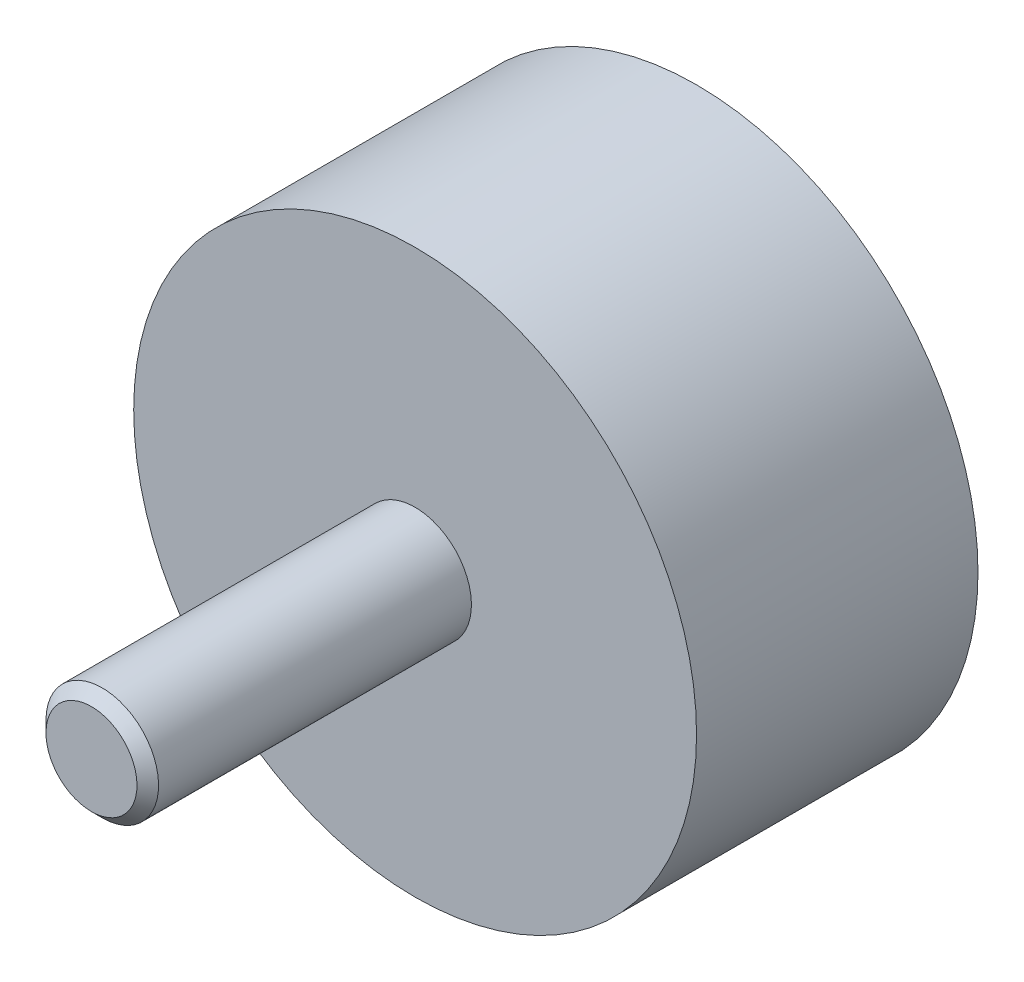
ISO-10303-21;
HEADER;
FILE_DESCRIPTION(('STEP AP214'),'2;1');
FILE_NAME('part.step','',(''),(''),'','','');
FILE_SCHEMA(('AUTOMOTIVE_DESIGN { 1 0 10303 214 1 1 1 1 }'));
ENDSEC;
DATA;
#1=APPLICATION_CONTEXT('core data for automotive mechanical design processes');
#2=APPLICATION_PROTOCOL_DEFINITION('international standard','automotive_design',2000,#1);
#3=PRODUCT_CONTEXT('',#1,'mechanical');
#4=PRODUCT('Part','Part','',(#3));
#5=PRODUCT_RELATED_PRODUCT_CATEGORY('part','',(#4));
#6=PRODUCT_DEFINITION_FORMATION('','',#4);
#7=PRODUCT_DEFINITION_CONTEXT('part definition',#1,'design');
#8=PRODUCT_DEFINITION('design','',#6,#7);
#9=PRODUCT_DEFINITION_SHAPE('','',#8);
#10=(LENGTH_UNIT() NAMED_UNIT(*) SI_UNIT(.MILLI.,.METRE.));
#11=(NAMED_UNIT(*) PLANE_ANGLE_UNIT() SI_UNIT($,.RADIAN.));
#12=(NAMED_UNIT(*) SI_UNIT($,.STERADIAN.) SOLID_ANGLE_UNIT());
#13=UNCERTAINTY_MEASURE_WITH_UNIT(LENGTH_MEASURE(1.E-05),#10,'distance_accuracy_value','');
#14=(GEOMETRIC_REPRESENTATION_CONTEXT(3) GLOBAL_UNCERTAINTY_ASSIGNED_CONTEXT((#13)) GLOBAL_UNIT_ASSIGNED_CONTEXT((#10,
#11,#12)) REPRESENTATION_CONTEXT('',''));
#15=CARTESIAN_POINT('',(0.,0.,0.));
#16=DIRECTION('',(0.,0.,1.));
#17=DIRECTION('',(1.,0.,0.));
#18=AXIS2_PLACEMENT_3D('',#15,#16,#17);
#19=CARTESIAN_POINT('',(18.666666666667,0.,20.));
#20=DIRECTION('',(0.,0.,1.));
#21=DIRECTION('',(0.,-1.,0.));
#22=AXIS2_PLACEMENT_3D('',#19,#20,#21);
#23=PLANE('',#22);
#24=CARTESIAN_POINT('',(0.,0.,20.));
#25=DIRECTION('',(0.,0.,1.));
#26=DIRECTION('',(0.,-1.,0.));
#27=AXIS2_PLACEMENT_3D('',#24,#25,#26);
#28=CIRCLE('',#27,4.);
#29=CARTESIAN_POINT('',(0.,-4.,20.));
#30=VERTEX_POINT('',#29);
#31=EDGE_CURVE('E23',#30,#30,#28,.T.);
#32=ORIENTED_EDGE('',*,*,#31,.F.);
#33=EDGE_LOOP('',(#32));
#34=FACE_BOUND('',#33,.T.);
#35=CARTESIAN_POINT('',(0.,0.,20.));
#36=DIRECTION('',(0.,0.,1.));
#37=DIRECTION('',(0.,-1.,0.));
#38=AXIS2_PLACEMENT_3D('',#35,#36,#37);
#39=CIRCLE('',#38,20.);
#40=CARTESIAN_POINT('',(0.,-20.,20.));
#41=VERTEX_POINT('',#40);
#42=EDGE_CURVE('E27',#41,#41,#39,.T.);
#43=ORIENTED_EDGE('',*,*,#42,.T.);
#44=EDGE_LOOP('',(#43));
#45=FACE_BOUND('',#44,.T.);
#46=ADVANCED_FACE('F12',(#34,#45),#23,.T.);
#47=CARTESIAN_POINT('',(0.,0.,0.66666666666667));
#48=DIRECTION('',(0.,0.,1.));
#49=DIRECTION('',(0.,-1.,0.));
#50=AXIS2_PLACEMENT_3D('',#47,#48,#49);
#51=CYLINDRICAL_SURFACE('',#50,20.);
#52=CARTESIAN_POINT('',(0.,0.,0.));
#53=DIRECTION('',(0.,0.,1.));
#54=DIRECTION('',(0.,-1.,0.));
#55=AXIS2_PLACEMENT_3D('',#52,#53,#54);
#56=CIRCLE('',#55,20.);
#57=CARTESIAN_POINT('',(0.,-20.,0.));
#58=VERTEX_POINT('',#57);
#59=EDGE_CURVE('E32',#58,#58,#56,.T.);
#60=ORIENTED_EDGE('',*,*,#59,.T.);
#61=EDGE_LOOP('',(#60));
#62=FACE_BOUND('',#61,.T.);
#63=ORIENTED_EDGE('',*,*,#42,.F.);
#64=EDGE_LOOP('',(#63));
#65=FACE_BOUND('',#64,.T.);
#66=ADVANCED_FACE('F63',(#62,#65),#51,.T.);
#67=CARTESIAN_POINT('',(20.,0.,0.));
#68=DIRECTION('',(0.,0.,-1.));
#69=DIRECTION('',(0.,1.,0.));
#70=AXIS2_PLACEMENT_3D('',#67,#68,#69);
#71=PLANE('',#70);
#72=CARTESIAN_POINT('',(0.,0.,0.));
#73=DIRECTION('',(0.,0.,-1.));
#74=DIRECTION('',(0.,1.,0.));
#75=AXIS2_PLACEMENT_3D('',#72,#73,#74);
#76=CIRCLE('',#75,4.5);
#77=CARTESIAN_POINT('',(0.,4.5,0.));
#78=VERTEX_POINT('',#77);
#79=EDGE_CURVE('E8',#78,#78,#76,.F.);
#80=ORIENTED_EDGE('',*,*,#79,.T.);
#81=EDGE_LOOP('',(#80));
#82=FACE_BOUND('',#81,.T.);
#83=ORIENTED_EDGE('',*,*,#59,.F.);
#84=EDGE_LOOP('',(#83));
#85=FACE_BOUND('',#84,.T.);
#86=ADVANCED_FACE('F68',(#82,#85),#71,.T.);
#87=CARTESIAN_POINT('',(0.,0.,43.));
#88=DIRECTION('',(0.,0.,1.));
#89=DIRECTION('',(0.,-1.,0.));
#90=AXIS2_PLACEMENT_3D('',#87,#88,#89);
#91=PLANE('',#90);
#92=CARTESIAN_POINT('',(0.,0.,43.));
#93=DIRECTION('',(0.,0.,1.));
#94=DIRECTION('',(0.,-1.,0.));
#95=AXIS2_PLACEMENT_3D('',#92,#93,#94);
#96=CIRCLE('',#95,3.233);
#97=CARTESIAN_POINT('',(0.,-3.233,43.));
#98=VERTEX_POINT('',#97);
#99=EDGE_CURVE('E35',#98,#98,#96,.T.);
#100=ORIENTED_EDGE('',*,*,#99,.T.);
#101=EDGE_LOOP('',(#100));
#102=FACE_BOUND('',#101,.T.);
#103=ADVANCED_FACE('F74',(#102),#91,.T.);
#104=CARTESIAN_POINT('',(0.,0.,43.));
#105=DIRECTION('',(0.,0.,-1.));
#106=DIRECTION('',(0.,1.,0.));
#107=AXIS2_PLACEMENT_3D('',#104,#105,#106);
#108=CONICAL_SURFACE('',#107,3.233,0.785398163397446);
#109=CARTESIAN_POINT('',(0.,0.,42.233));
#110=DIRECTION('',(0.,0.,1.));
#111=DIRECTION('',(0.,-1.,0.));
#112=AXIS2_PLACEMENT_3D('',#109,#110,#111);
#113=CIRCLE('',#112,4.);
#114=CARTESIAN_POINT('',(0.,-4.,42.233));
#115=VERTEX_POINT('',#114);
#116=EDGE_CURVE('E38',#115,#115,#113,.T.);
#117=ORIENTED_EDGE('',*,*,#116,.T.);
#118=EDGE_LOOP('',(#117));
#119=FACE_BOUND('',#118,.T.);
#120=ORIENTED_EDGE('',*,*,#99,.F.);
#121=EDGE_LOOP('',(#120));
#122=FACE_BOUND('',#121,.T.);
#123=ADVANCED_FACE('F57',(#119,#122),#108,.T.);
#124=CARTESIAN_POINT('',(0.,0.,20.));
#125=DIRECTION('',(0.,0.,1.));
#126=DIRECTION('',(0.,-1.,0.));
#127=AXIS2_PLACEMENT_3D('',#124,#125,#126);
#128=CYLINDRICAL_SURFACE('',#127,4.);
#129=ORIENTED_EDGE('',*,*,#31,.T.);
#130=EDGE_LOOP('',(#129));
#131=FACE_BOUND('',#130,.T.);
#132=ORIENTED_EDGE('',*,*,#116,.F.);
#133=EDGE_LOOP('',(#132));
#134=FACE_BOUND('',#133,.T.);
#135=ADVANCED_FACE('F49',(#131,#134),#128,.T.);
#136=CARTESIAN_POINT('',(0.,0.,0.));
#137=DIRECTION('',(0.,0.,1.));
#138=DIRECTION('',(0.,-1.,0.));
#139=AXIS2_PLACEMENT_3D('',#136,#137,#138);
#140=CYLINDRICAL_SURFACE('',#139,4.);
#141=CARTESIAN_POINT('',(0.,0.,0.499999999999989));
#142=DIRECTION('',(0.,0.,-1.));
#143=DIRECTION('',(0.,1.,0.));
#144=AXIS2_PLACEMENT_3D('',#141,#142,#143);
#145=CIRCLE('',#144,4.);
#146=CARTESIAN_POINT('',(0.,4.,0.499999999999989));
#147=VERTEX_POINT('',#146);
#148=EDGE_CURVE('E19',#147,#147,#145,.T.);
#149=ORIENTED_EDGE('',*,*,#148,.T.);
#150=EDGE_LOOP('',(#149));
#151=FACE_BOUND('',#150,.T.);
#152=CARTESIAN_POINT('',(0.,0.,8.));
#153=DIRECTION('',(0.,0.,-1.));
#154=DIRECTION('',(0.,1.,0.));
#155=AXIS2_PLACEMENT_3D('',#152,#153,#154);
#156=CIRCLE('',#155,4.);
#157=CARTESIAN_POINT('',(0.,4.,8.));
#158=VERTEX_POINT('',#157);
#159=EDGE_CURVE('E41',#158,#158,#156,.T.);
#160=ORIENTED_EDGE('',*,*,#159,.F.);
#161=EDGE_LOOP('',(#160));
#162=FACE_BOUND('',#161,.T.);
#163=ADVANCED_FACE('F47',(#151,#162),#140,.F.);
#164=CARTESIAN_POINT('',(0.,0.,8.));
#165=DIRECTION('',(0.,0.,-1.));
#166=DIRECTION('',(0.,1.,0.));
#167=AXIS2_PLACEMENT_3D('',#164,#165,#166);
#168=PLANE('',#167);
#169=ORIENTED_EDGE('',*,*,#159,.T.);
#170=EDGE_LOOP('',(#169));
#171=FACE_BOUND('',#170,.T.);
#172=ADVANCED_FACE('F45',(#171),#168,.T.);
#173=CARTESIAN_POINT('',(0.,0.,0.499999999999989));
#174=DIRECTION('',(0.,0.,-1.));
#175=DIRECTION('',(0.,1.,0.));
#176=AXIS2_PLACEMENT_3D('',#173,#174,#175);
#177=CONICAL_SURFACE('',#176,4.,0.785398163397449);
#178=ORIENTED_EDGE('',*,*,#79,.F.);
#179=EDGE_LOOP('',(#178));
#180=FACE_BOUND('',#179,.T.);
#181=ORIENTED_EDGE('',*,*,#148,.F.);
#182=EDGE_LOOP('',(#181));
#183=FACE_BOUND('',#182,.T.);
#184=ADVANCED_FACE('F14',(#180,#183),#177,.F.);
#185=CLOSED_SHELL('',(#46,#66,#86,#103,#123,#135,#163,#172,#184));
#186=MANIFOLD_SOLID_BREP('B1',#185);
#187=ADVANCED_BREP_SHAPE_REPRESENTATION('',(#18,#186),#14);
#188=SHAPE_DEFINITION_REPRESENTATION(#9,#187);
ENDSEC;
END-ISO-10303-21;
